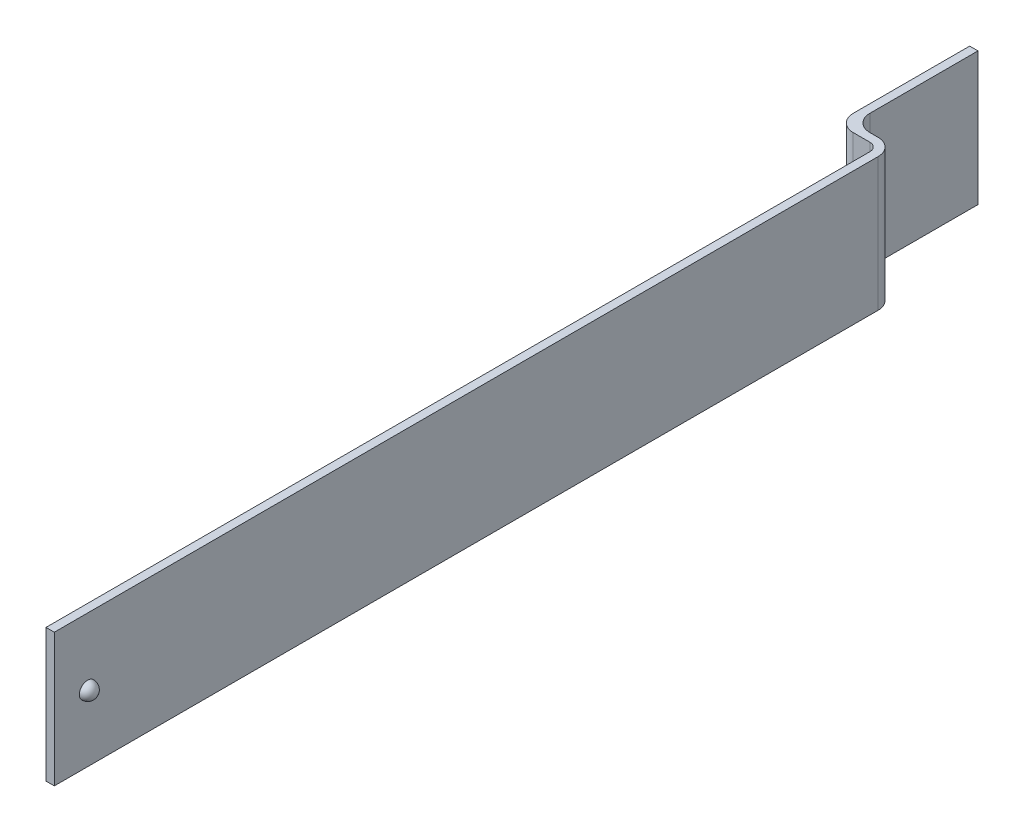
from build123d import *

# Parameters (mm, degrees)
ESQUISSE1_W      = 0.5
ESQUISSE1_H      = 8
EXTRUSION1_DEPTH = 50
EXTRUSION2_DEPTH = 8
CONG_1_R         = 1
CONG_2_R         = 0.5


with BuildPart() as part:
    # Esquisse1 → Extrusion1 (new body)
    with BuildSketch(Plane.XY):
        with Locations((0.25, 4)):
            Rectangle(ESQUISSE1_W, ESQUISSE1_H)
    extrude(amount=EXTRUSION1_DEPTH)

    # Esquisse2 → Extrusion2 (add)
    with BuildSketch(Plane(origin=(0, 0, 0), x_dir=(1, 0, 0), z_dir=(0, 1, 0))):
        Polygon((0.5, 0), (0.5, 0.5), (-2, 0.5), (-2, 8), (-2.5, 8), (-2.5, 0), (0, 0), align=None)
    extrude(amount=EXTRUSION2_DEPTH)

    # Cong_1
    cong_1_edges = [part.edges().sort_by_distance(p)[0] for p in [
        (-2.5, 4, 0),
        (-2, 4, -0.5),
        (0.5, 4, -0.5),
    ]]
    fillet(cong_1_edges, radius=CONG_1_R)

    # Cong_2
    cong_2_edges = [part.edges().sort_by_distance(p)[0] for p in [
        (0, 4, 0),
    ]]
    fillet(cong_2_edges, radius=CONG_2_R)

    # Esquisse4 → R_volution1 (revolve)
    with BuildSketch(Plane.XZ.offset(-4)):
        with BuildLine():
            Line((0.5, 48.5), (0.5, 48))
            Line((0.5, 48), (1, 48))
            ThreePointArc((1, 48), (0.853553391, 48.353553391), (0.5, 48.5))
        make_face()
    revolve(axis=Axis((0.5, 4, 48), (1, 0, 0)))


solid = part.part
